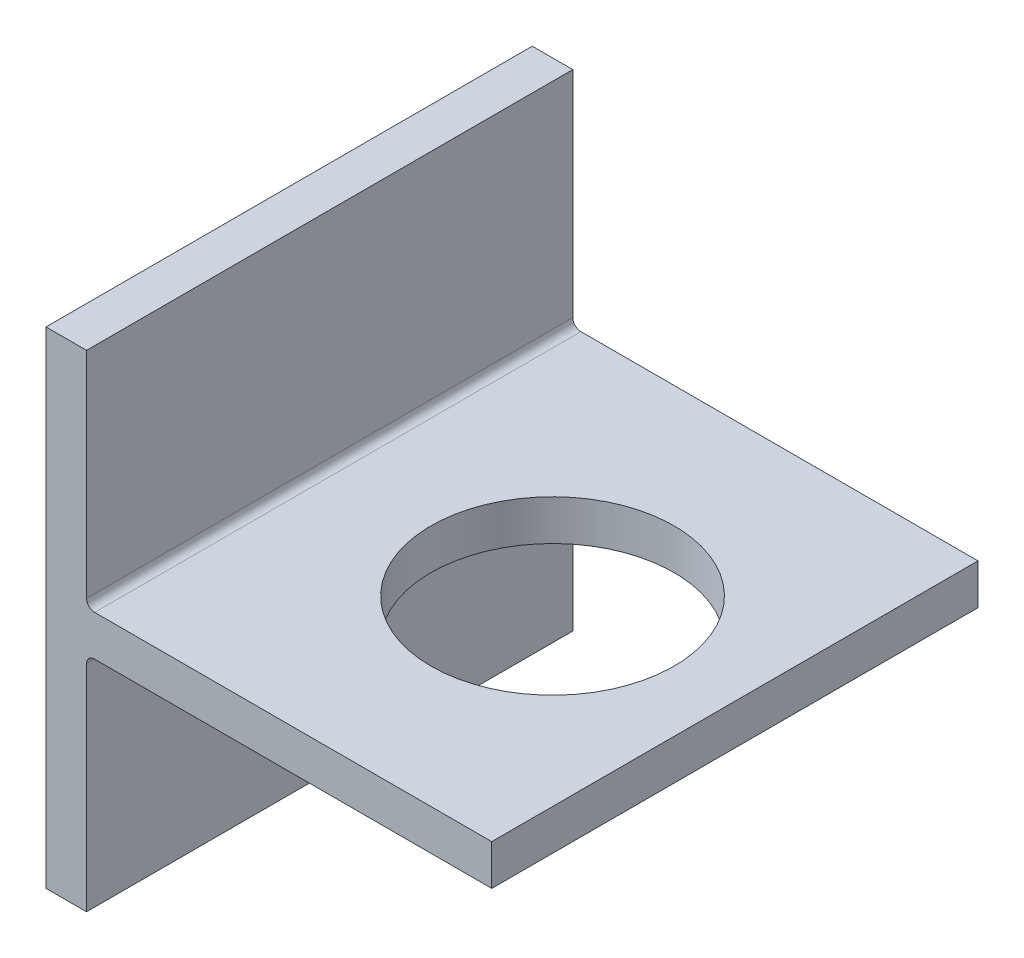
from build123d import *

# Parameters (mm, degrees)
BASE_EXTRUDE_DEPTH  = 120
FILLET1_R           = 2
EXTRUDE1_DEPTH      = 174.493515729
EXTRUDE1_DEPTH_BACK = 174.493515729
SKETCH2_R           = 30


with BuildPart() as part:
    # Sketch1 → Base-Extrude (new body)
    with BuildSketch(Plane.XY):
        Polygon((0, -60), (10, -60), (10, -5), (110, -5), (110, 5), (10, 5), (10, 60), (0, 60), align=None)
    extrude(amount=BASE_EXTRUDE_DEPTH)

    # Fillet1
    fillet1_edges = [part.edges().sort_by_distance(p)[0] for p in [
        (10, 5, 60),
        (10, -5, 60),
    ]]
    fillet(fillet1_edges, radius=FILLET1_R)

    # Sketch2 → Extrude1 (cut, two sides: drawn at the far end of the back side and taken through both)
    with BuildSketch(Plane(origin=(0, 0, 0), x_dir=(-1, 0, 0), z_dir=(0, 1, 0)).offset(-EXTRUDE1_DEPTH_BACK)):
        with Locations(Location((-65, 60, 0), (0, 0, 90))):
            Circle(SKETCH2_R)
    extrude(amount=EXTRUDE1_DEPTH + EXTRUDE1_DEPTH_BACK, mode=Mode.SUBTRACT)


solid = part.part
